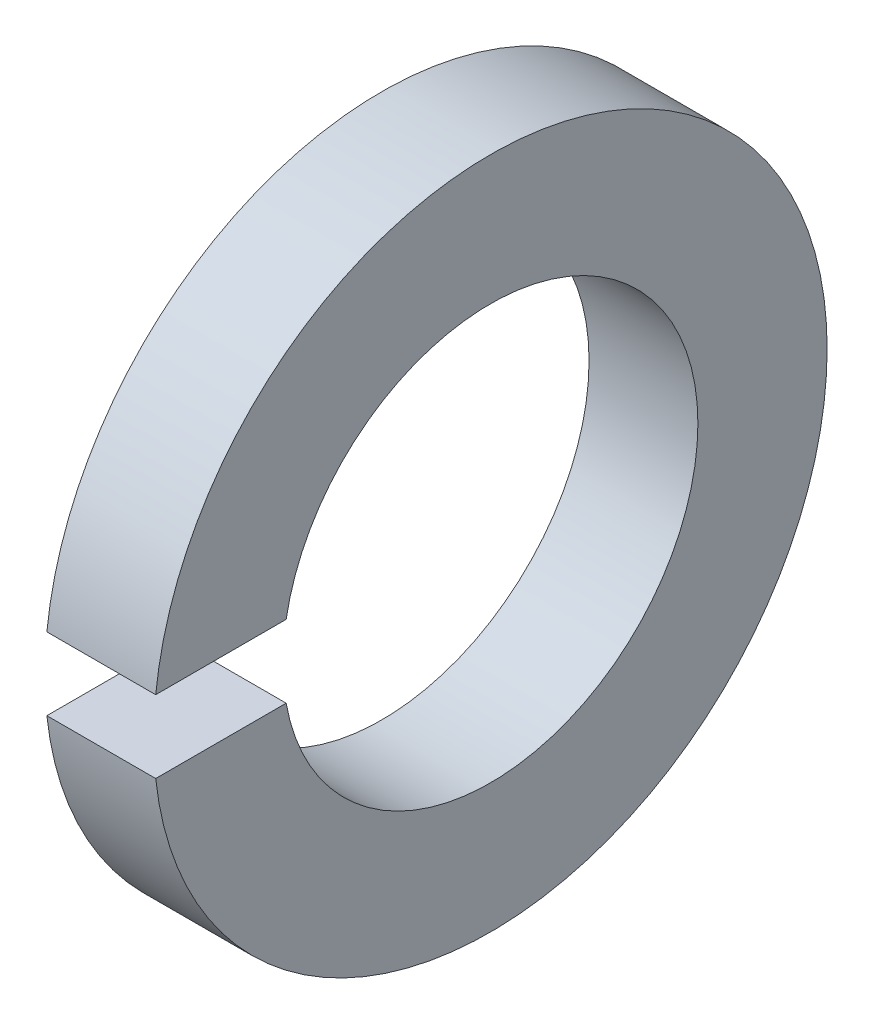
ISO-10303-21;
HEADER;
FILE_DESCRIPTION(('STEP AP214'),'2;1');
FILE_NAME('part.step','',(''),(''),'','','');
FILE_SCHEMA(('AUTOMOTIVE_DESIGN { 1 0 10303 214 1 1 1 1 }'));
ENDSEC;
DATA;
#1=APPLICATION_CONTEXT('core data for automotive mechanical design processes');
#2=APPLICATION_PROTOCOL_DEFINITION('international standard','automotive_design',2000,#1);
#3=PRODUCT_CONTEXT('',#1,'mechanical');
#4=PRODUCT('Part','Part','',(#3));
#5=PRODUCT_RELATED_PRODUCT_CATEGORY('part','',(#4));
#6=PRODUCT_DEFINITION_FORMATION('','',#4);
#7=PRODUCT_DEFINITION_CONTEXT('part definition',#1,'design');
#8=PRODUCT_DEFINITION('design','',#6,#7);
#9=PRODUCT_DEFINITION_SHAPE('','',#8);
#10=(LENGTH_UNIT() NAMED_UNIT(*) SI_UNIT(.MILLI.,.METRE.));
#11=(NAMED_UNIT(*) PLANE_ANGLE_UNIT() SI_UNIT($,.RADIAN.));
#12=(NAMED_UNIT(*) SI_UNIT($,.STERADIAN.) SOLID_ANGLE_UNIT());
#13=UNCERTAINTY_MEASURE_WITH_UNIT(LENGTH_MEASURE(1.E-05),#10,'distance_accuracy_value','');
#14=(GEOMETRIC_REPRESENTATION_CONTEXT(3) GLOBAL_UNCERTAINTY_ASSIGNED_CONTEXT((#13)) GLOBAL_UNIT_ASSIGNED_CONTEXT((#10,
#11,#12)) REPRESENTATION_CONTEXT('',''));
#15=CARTESIAN_POINT('',(0.,0.,0.));
#16=DIRECTION('',(0.,0.,1.));
#17=DIRECTION('',(1.,0.,0.));
#18=AXIS2_PLACEMENT_3D('',#15,#16,#17);
#19=CARTESIAN_POINT('',(38.4,28.0000000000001,-81.0000000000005));
#20=DIRECTION('',(-1.,0.,0.));
#21=DIRECTION('',(0.,0.,1.00000000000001));
#22=AXIS2_PLACEMENT_3D('',#19,#20,#21);
#23=CYLINDRICAL_SURFACE('',#22,4.95);
#24=CARTESIAN_POINT('',(37.6,28.0000000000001,-81.0000000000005));
#25=DIRECTION('',(1.,0.,0.));
#26=DIRECTION('',(0.,1.00000000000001,0.));
#27=AXIS2_PLACEMENT_3D('',#24,#25,#26);
#28=CIRCLE('',#27,4.95);
#29=CARTESIAN_POINT('',(37.6,27.4666666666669,-76.078815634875));
#30=VERTEX_POINT('',#29);
#31=CARTESIAN_POINT('',(37.6,28.5333333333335,-76.078815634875));
#32=VERTEX_POINT('',#31);
#33=EDGE_CURVE('E9',#30,#32,#28,.T.);
#34=ORIENTED_EDGE('',*,*,#33,.T.);
#35=DIRECTION('',(1.,0.,0.));
#36=VECTOR('',#35,1.);
#37=CARTESIAN_POINT('',(38.4,28.5333333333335,-76.078815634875));
#38=LINE('',#37,#36);
#39=CARTESIAN_POINT('',(39.2,28.5333333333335,-76.078815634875));
#40=VERTEX_POINT('',#39);
#41=EDGE_CURVE('E48',#32,#40,#38,.T.);
#42=ORIENTED_EDGE('',*,*,#41,.T.);
#43=CARTESIAN_POINT('',(39.2,28.0000000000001,-81.0000000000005));
#44=DIRECTION('',(1.,0.,0.));
#45=DIRECTION('',(0.,1.00000000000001,0.));
#46=AXIS2_PLACEMENT_3D('',#43,#44,#45);
#47=CIRCLE('',#46,4.95);
#48=CARTESIAN_POINT('',(39.2,27.4666666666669,-76.078815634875));
#49=VERTEX_POINT('',#48);
#50=EDGE_CURVE('E50',#49,#40,#47,.T.);
#51=ORIENTED_EDGE('',*,*,#50,.F.);
#52=DIRECTION('',(-1.,0.,0.));
#53=VECTOR('',#52,1.);
#54=CARTESIAN_POINT('',(38.4,27.4666666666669,-76.078815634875));
#55=LINE('',#54,#53);
#56=EDGE_CURVE('E58',#49,#30,#55,.T.);
#57=ORIENTED_EDGE('',*,*,#56,.T.);
#58=EDGE_LOOP('',(#34,#42,#51,#57));
#59=FACE_BOUND('',#58,.T.);
#60=ADVANCED_FACE('F14',(#59),#23,.T.);
#61=CARTESIAN_POINT('',(37.6,32.0000000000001,-81.0000000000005));
#62=DIRECTION('',(-1.,0.,0.));
#63=DIRECTION('',(0.,0.,1.00000000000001));
#64=AXIS2_PLACEMENT_3D('',#61,#62,#63);
#65=PLANE('',#64);
#66=DIRECTION('',(0.,0.,1.00000000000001));
#67=VECTOR('',#66,1.);
#68=CARTESIAN_POINT('',(37.6,28.5333333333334,-81.0000000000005));
#69=LINE('',#68,#67);
#70=CARTESIAN_POINT('',(37.6,28.5333333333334,-77.9969922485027));
#71=VERTEX_POINT('',#70);
#72=EDGE_CURVE('E25',#71,#32,#69,.T.);
#73=ORIENTED_EDGE('',*,*,#72,.T.);
#74=ORIENTED_EDGE('',*,*,#33,.F.);
#75=DIRECTION('',(0.,0.,-1.00000000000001));
#76=VECTOR('',#75,1.);
#77=CARTESIAN_POINT('',(37.6,27.4666666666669,-81.0000000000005));
#78=LINE('',#77,#76);
#79=CARTESIAN_POINT('',(37.6,27.4666666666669,-77.9969922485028));
#80=VERTEX_POINT('',#79);
#81=EDGE_CURVE('E78',#30,#80,#78,.T.);
#82=ORIENTED_EDGE('',*,*,#81,.T.);
#83=CARTESIAN_POINT('',(37.6,28.0000000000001,-81.0000000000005));
#84=DIRECTION('',(1.,0.,0.));
#85=DIRECTION('',(0.,1.00000000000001,0.));
#86=AXIS2_PLACEMENT_3D('',#83,#84,#85);
#87=CIRCLE('',#86,3.05);
#88=EDGE_CURVE('E73',#80,#71,#87,.T.);
#89=ORIENTED_EDGE('',*,*,#88,.T.);
#90=EDGE_LOOP('',(#73,#74,#82,#89));
#91=FACE_BOUND('',#90,.T.);
#92=ADVANCED_FACE('F102',(#91),#65,.T.);
#93=CARTESIAN_POINT('',(39.2,32.0000000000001,-81.0000000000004));
#94=DIRECTION('',(1.,0.,0.));
#95=DIRECTION('',(0.,0.,-1.00000000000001));
#96=AXIS2_PLACEMENT_3D('',#93,#94,#95);
#97=PLANE('',#96);
#98=DIRECTION('',(0.,0.,-1.00000000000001));
#99=VECTOR('',#98,1.);
#100=CARTESIAN_POINT('',(39.2,28.5333333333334,-81.0000000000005));
#101=LINE('',#100,#99);
#102=CARTESIAN_POINT('',(39.2,28.5333333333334,-77.9969922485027));
#103=VERTEX_POINT('',#102);
#104=EDGE_CURVE('E18',#40,#103,#101,.T.);
#105=ORIENTED_EDGE('',*,*,#104,.T.);
#106=CARTESIAN_POINT('',(39.2,28.0000000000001,-81.0000000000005));
#107=DIRECTION('',(1.,0.,0.));
#108=DIRECTION('',(0.,1.00000000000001,0.));
#109=AXIS2_PLACEMENT_3D('',#106,#107,#108);
#110=CIRCLE('',#109,3.05);
#111=CARTESIAN_POINT('',(39.2,27.4666666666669,-77.9969922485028));
#112=VERTEX_POINT('',#111);
#113=EDGE_CURVE('E57',#112,#103,#110,.T.);
#114=ORIENTED_EDGE('',*,*,#113,.F.);
#115=DIRECTION('',(0.,0.,1.00000000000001));
#116=VECTOR('',#115,1.);
#117=CARTESIAN_POINT('',(39.2,27.4666666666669,-81.0000000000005));
#118=LINE('',#117,#116);
#119=EDGE_CURVE('E65',#112,#49,#118,.T.);
#120=ORIENTED_EDGE('',*,*,#119,.T.);
#121=ORIENTED_EDGE('',*,*,#50,.T.);
#122=EDGE_LOOP('',(#105,#114,#120,#121));
#123=FACE_BOUND('',#122,.T.);
#124=ADVANCED_FACE('F62',(#123),#97,.T.);
#125=CARTESIAN_POINT('',(38.4,28.0000000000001,-81.0000000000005));
#126=DIRECTION('',(-1.,0.,0.));
#127=DIRECTION('',(0.,0.,1.00000000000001));
#128=AXIS2_PLACEMENT_3D('',#125,#126,#127);
#129=CYLINDRICAL_SURFACE('',#128,3.05);
#130=DIRECTION('',(-1.,0.,0.));
#131=VECTOR('',#130,1.);
#132=CARTESIAN_POINT('',(38.4,28.5333333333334,-77.9969922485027));
#133=LINE('',#132,#131);
#134=EDGE_CURVE('E67',#103,#71,#133,.T.);
#135=ORIENTED_EDGE('',*,*,#134,.T.);
#136=ORIENTED_EDGE('',*,*,#88,.F.);
#137=DIRECTION('',(1.,0.,0.));
#138=VECTOR('',#137,1.);
#139=CARTESIAN_POINT('',(38.4,27.4666666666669,-77.9969922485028));
#140=LINE('',#139,#138);
#141=EDGE_CURVE('E85',#80,#112,#140,.T.);
#142=ORIENTED_EDGE('',*,*,#141,.T.);
#143=ORIENTED_EDGE('',*,*,#113,.T.);
#144=EDGE_LOOP('',(#135,#136,#142,#143));
#145=FACE_BOUND('',#144,.T.);
#146=ADVANCED_FACE('F16',(#145),#129,.F.);
#147=CARTESIAN_POINT('',(39.2,27.4666666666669,-81.0000000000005));
#148=DIRECTION('',(0.,1.00000000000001,0.));
#149=DIRECTION('',(0.,0.,1.00000000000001));
#150=AXIS2_PLACEMENT_3D('',#147,#148,#149);
#151=PLANE('',#150);
#152=ORIENTED_EDGE('',*,*,#141,.F.);
#153=ORIENTED_EDGE('',*,*,#81,.F.);
#154=ORIENTED_EDGE('',*,*,#56,.F.);
#155=ORIENTED_EDGE('',*,*,#119,.F.);
#156=EDGE_LOOP('',(#152,#153,#154,#155));
#157=FACE_BOUND('',#156,.T.);
#158=ADVANCED_FACE('F99',(#157),#151,.T.);
#159=CARTESIAN_POINT('',(37.6,28.5333333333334,-81.0000000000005));
#160=DIRECTION('',(0.,-1.00000000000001,0.));
#161=DIRECTION('',(0.,0.,-1.00000000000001));
#162=AXIS2_PLACEMENT_3D('',#159,#160,#161);
#163=PLANE('',#162);
#164=ORIENTED_EDGE('',*,*,#41,.F.);
#165=ORIENTED_EDGE('',*,*,#72,.F.);
#166=ORIENTED_EDGE('',*,*,#134,.F.);
#167=ORIENTED_EDGE('',*,*,#104,.F.);
#168=EDGE_LOOP('',(#164,#165,#166,#167));
#169=FACE_BOUND('',#168,.T.);
#170=ADVANCED_FACE('F70',(#169),#163,.T.);
#171=CLOSED_SHELL('',(#60,#92,#124,#146,#158,#170));
#172=MANIFOLD_SOLID_BREP('B1',#171);
#173=ADVANCED_BREP_SHAPE_REPRESENTATION('',(#18,#172),#14);
#174=SHAPE_DEFINITION_REPRESENTATION(#9,#173);
ENDSEC;
END-ISO-10303-21;
